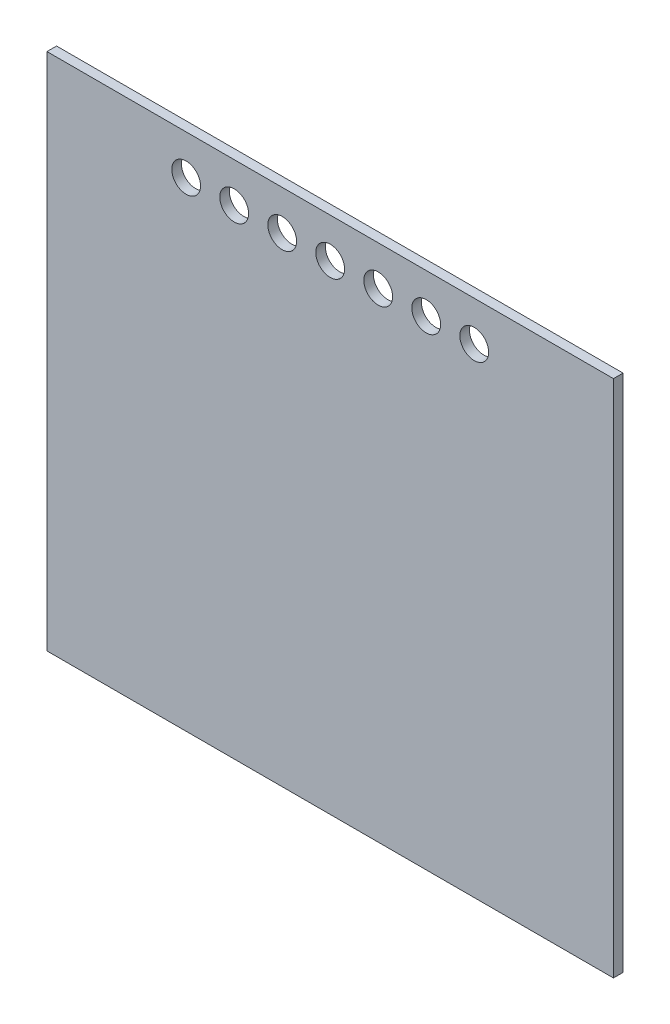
from build123d import *

# Parameters (mm, degrees)
SKETCH1_W           = 749.3
SKETCH1_H           = 686.5874
BOSS_EXTRUDE1_DEPTH = 12.7
SKETCH2_R           = 19.05
CUT_EXTRUDE1_DEPTH  = 509.305495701


with BuildPart() as part:
    # Sketch1 → Boss-Extrude1 (new body)
    with BuildSketch(Plane.XY):
        Rectangle(SKETCH1_W, SKETCH1_H)
    extrude(amount=-BOSS_EXTRUDE1_DEPTH)

    # Sketch2 → Cut-Extrude1 (cut, through all)
    with BuildSketch(Plane.XY):
        with Locations((-190.5, 290.9062)):
            Circle(SKETCH2_R)
        with Locations((190.5, 290.9062)):
            Circle(SKETCH2_R)
        with Locations((-127, 290.9062)):
            Circle(SKETCH2_R)
        with Locations((-63.5, 290.9062)):
            Circle(SKETCH2_R)
        with Locations((0, 290.9062)):
            Circle(SKETCH2_R)
        with Locations((63.5, 290.9062)):
            Circle(SKETCH2_R)
        with Locations((127, 290.9062)):
            Circle(SKETCH2_R)
    extrude(amount=-CUT_EXTRUDE1_DEPTH, mode=Mode.SUBTRACT)


solid = part.part
